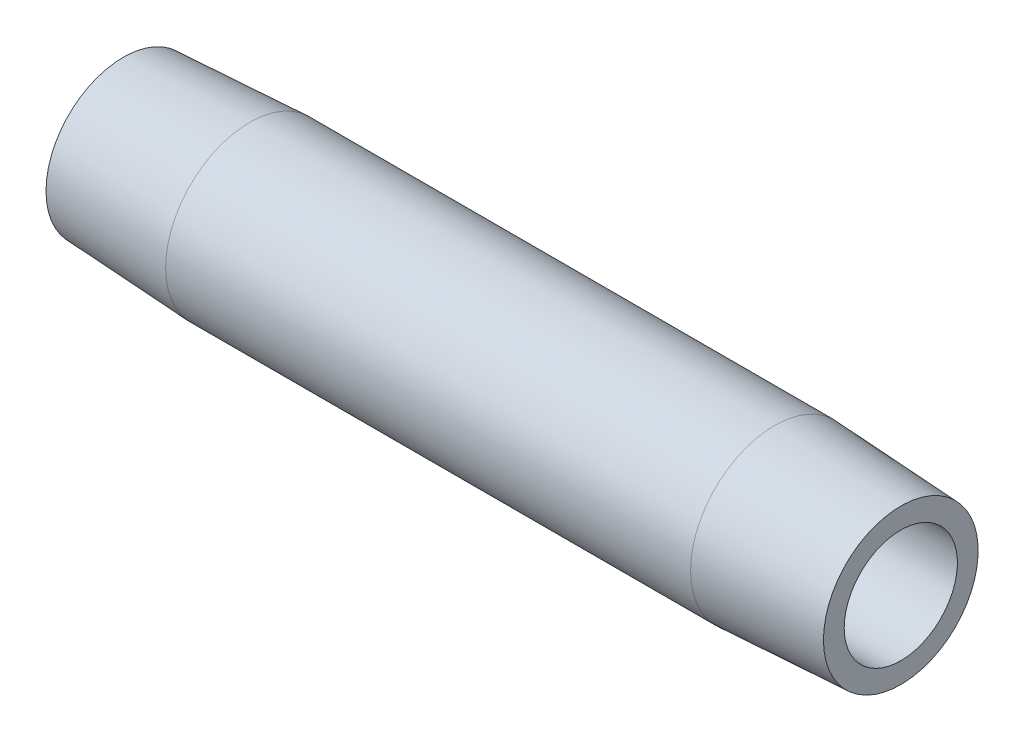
ISO-10303-21;
HEADER;
FILE_DESCRIPTION(('STEP AP214'),'2;1');
FILE_NAME('part.step','',(''),(''),'','','');
FILE_SCHEMA(('AUTOMOTIVE_DESIGN { 1 0 10303 214 1 1 1 1 }'));
ENDSEC;
DATA;
#1=APPLICATION_CONTEXT('core data for automotive mechanical design processes');
#2=APPLICATION_PROTOCOL_DEFINITION('international standard','automotive_design',2000,#1);
#3=PRODUCT_CONTEXT('',#1,'mechanical');
#4=PRODUCT('Part','Part','',(#3));
#5=PRODUCT_RELATED_PRODUCT_CATEGORY('part','',(#4));
#6=PRODUCT_DEFINITION_FORMATION('','',#4);
#7=PRODUCT_DEFINITION_CONTEXT('part definition',#1,'design');
#8=PRODUCT_DEFINITION('design','',#6,#7);
#9=PRODUCT_DEFINITION_SHAPE('','',#8);
#10=(LENGTH_UNIT() NAMED_UNIT(*) SI_UNIT(.MILLI.,.METRE.));
#11=(NAMED_UNIT(*) PLANE_ANGLE_UNIT() SI_UNIT($,.RADIAN.));
#12=(NAMED_UNIT(*) SI_UNIT($,.STERADIAN.) SOLID_ANGLE_UNIT());
#13=UNCERTAINTY_MEASURE_WITH_UNIT(LENGTH_MEASURE(1.E-05),#10,'distance_accuracy_value','');
#14=(GEOMETRIC_REPRESENTATION_CONTEXT(3) GLOBAL_UNCERTAINTY_ASSIGNED_CONTEXT((#13)) GLOBAL_UNIT_ASSIGNED_CONTEXT((#10,
#11,#12)) REPRESENTATION_CONTEXT('',''));
#15=CARTESIAN_POINT('',(0.,0.,0.));
#16=DIRECTION('',(0.,0.,1.));
#17=DIRECTION('',(1.,0.,0.));
#18=AXIS2_PLACEMENT_3D('',#15,#16,#17);
#19=CARTESIAN_POINT('',(63.5,0.,-4.62277681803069));
#20=DIRECTION('',(-1.,0.,0.));
#21=DIRECTION('',(0.,0.,1.));
#22=AXIS2_PLACEMENT_3D('',#19,#20,#21);
#23=PLANE('',#22);
#24=CARTESIAN_POINT('',(63.5,0.,0.));
#25=DIRECTION('',(-1.,0.,0.));
#26=DIRECTION('',(0.,0.,1.));
#27=AXIS2_PLACEMENT_3D('',#24,#25,#26);
#28=CIRCLE('',#27,6.31752683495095);
#29=CARTESIAN_POINT('',(63.5,0.,6.31752683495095));
#30=VERTEX_POINT('',#29);
#31=EDGE_CURVE('E10',#30,#30,#28,.T.);
#32=ORIENTED_EDGE('',*,*,#31,.F.);
#33=EDGE_LOOP('',(#32));
#34=FACE_BOUND('',#33,.T.);
#35=CARTESIAN_POINT('',(63.5,0.,0.));
#36=DIRECTION('',(-1.,0.,0.));
#37=DIRECTION('',(0.,0.,1.));
#38=AXIS2_PLACEMENT_3D('',#35,#36,#37);
#39=CIRCLE('',#38,4.62277681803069);
#40=CARTESIAN_POINT('',(63.5,0.,4.62277681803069));
#41=VERTEX_POINT('',#40);
#42=EDGE_CURVE('E52',#41,#41,#39,.T.);
#43=ORIENTED_EDGE('',*,*,#42,.T.);
#44=EDGE_LOOP('',(#43));
#45=FACE_BOUND('',#44,.T.);
#46=ADVANCED_FACE('F30',(#34,#45),#23,.F.);
#47=CARTESIAN_POINT('',(63.5,0.,0.));
#48=DIRECTION('',(-1.,0.,0.));
#49=DIRECTION('',(0.,0.,1.));
#50=AXIS2_PLACEMENT_3D('',#47,#48,#49);
#51=CONICAL_SURFACE('',#50,6.31752683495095,0.052359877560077);
#52=CARTESIAN_POINT('',(53.1876000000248,0.,0.));
#53=DIRECTION('',(-1.,0.,0.));
#54=DIRECTION('',(0.,0.,1.));
#55=AXIS2_PLACEMENT_3D('',#52,#53,#54);
#56=CIRCLE('',#55,6.85797681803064);
#57=CARTESIAN_POINT('',(53.1876000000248,0.,6.85797681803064));
#58=VERTEX_POINT('',#57);
#59=EDGE_CURVE('E36',#58,#58,#56,.T.);
#60=ORIENTED_EDGE('',*,*,#59,.F.);
#61=EDGE_LOOP('',(#60));
#62=FACE_BOUND('',#61,.T.);
#63=ORIENTED_EDGE('',*,*,#31,.T.);
#64=EDGE_LOOP('',(#63));
#65=FACE_BOUND('',#64,.T.);
#66=ADVANCED_FACE('F77',(#62,#65),#51,.T.);
#67=CARTESIAN_POINT('',(-6.37599469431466,0.,0.));
#68=DIRECTION('',(-1.,0.,0.));
#69=DIRECTION('',(0.,0.,1.));
#70=AXIS2_PLACEMENT_3D('',#67,#68,#69);
#71=CYLINDRICAL_SURFACE('',#70,6.85797681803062);
#72=CARTESIAN_POINT('',(10.3123999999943,0.,0.));
#73=DIRECTION('',(-1.,0.,0.));
#74=DIRECTION('',(0.,0.,1.));
#75=AXIS2_PLACEMENT_3D('',#72,#73,#74);
#76=CIRCLE('',#75,6.8579768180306);
#77=CARTESIAN_POINT('',(10.3123999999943,0.,6.8579768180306));
#78=VERTEX_POINT('',#77);
#79=EDGE_CURVE('E40',#78,#78,#76,.T.);
#80=ORIENTED_EDGE('',*,*,#79,.F.);
#81=EDGE_LOOP('',(#80));
#82=FACE_BOUND('',#81,.T.);
#83=ORIENTED_EDGE('',*,*,#59,.T.);
#84=EDGE_LOOP('',(#83));
#85=FACE_BOUND('',#84,.T.);
#86=ADVANCED_FACE('F72',(#82,#85),#71,.T.);
#87=CARTESIAN_POINT('',(10.3123999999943,0.,0.));
#88=DIRECTION('',(1.,0.,0.));
#89=DIRECTION('',(0.,0.,-1.));
#90=AXIS2_PLACEMENT_3D('',#87,#88,#89);
#91=CONICAL_SURFACE('',#90,6.8579768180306,0.0523598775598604);
#92=CARTESIAN_POINT('',(1.90819582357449E-11,0.,0.));
#93=DIRECTION('',(-1.,0.,0.));
#94=DIRECTION('',(0.,0.,1.));
#95=AXIS2_PLACEMENT_3D('',#92,#93,#94);
#96=CIRCLE('',#95,6.31752683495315);
#97=CARTESIAN_POINT('',(1.90819582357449E-11,0.,6.31752683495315));
#98=VERTEX_POINT('',#97);
#99=EDGE_CURVE('E44',#98,#98,#96,.T.);
#100=ORIENTED_EDGE('',*,*,#99,.F.);
#101=EDGE_LOOP('',(#100));
#102=FACE_BOUND('',#101,.T.);
#103=ORIENTED_EDGE('',*,*,#79,.T.);
#104=EDGE_LOOP('',(#103));
#105=FACE_BOUND('',#104,.T.);
#106=ADVANCED_FACE('F66',(#102,#105),#91,.T.);
#107=CARTESIAN_POINT('',(1.90819582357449E-11,0.,-6.31752683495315));
#108=DIRECTION('',(1.,0.,0.));
#109=DIRECTION('',(0.,0.,-1.));
#110=AXIS2_PLACEMENT_3D('',#107,#108,#109);
#111=PLANE('',#110);
#112=CARTESIAN_POINT('',(1.90819582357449E-11,0.,0.));
#113=DIRECTION('',(-1.,0.,0.));
#114=DIRECTION('',(0.,0.,1.));
#115=AXIS2_PLACEMENT_3D('',#112,#113,#114);
#116=CIRCLE('',#115,4.62277681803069);
#117=CARTESIAN_POINT('',(1.90819582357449E-11,0.,4.62277681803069));
#118=VERTEX_POINT('',#117);
#119=EDGE_CURVE('E49',#118,#118,#116,.T.);
#120=ORIENTED_EDGE('',*,*,#119,.F.);
#121=EDGE_LOOP('',(#120));
#122=FACE_BOUND('',#121,.T.);
#123=ORIENTED_EDGE('',*,*,#99,.T.);
#124=EDGE_LOOP('',(#123));
#125=FACE_BOUND('',#124,.T.);
#126=ADVANCED_FACE('F60',(#122,#125),#111,.F.);
#127=CARTESIAN_POINT('',(-6.37599469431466,0.,0.));
#128=DIRECTION('',(-1.,0.,0.));
#129=DIRECTION('',(0.,0.,1.));
#130=AXIS2_PLACEMENT_3D('',#127,#128,#129);
#131=CYLINDRICAL_SURFACE('',#130,4.62277681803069);
#132=ORIENTED_EDGE('',*,*,#42,.F.);
#133=EDGE_LOOP('',(#132));
#134=FACE_BOUND('',#133,.T.);
#135=ORIENTED_EDGE('',*,*,#119,.T.);
#136=EDGE_LOOP('',(#135));
#137=FACE_BOUND('',#136,.T.);
#138=ADVANCED_FACE('F57',(#134,#137),#131,.F.);
#139=CLOSED_SHELL('',(#46,#66,#86,#106,#126,#138));
#140=MANIFOLD_SOLID_BREP('B2',#139);
#141=ADVANCED_BREP_SHAPE_REPRESENTATION('',(#18,#140),#14);
#142=SHAPE_DEFINITION_REPRESENTATION(#9,#141);
ENDSEC;
END-ISO-10303-21;
